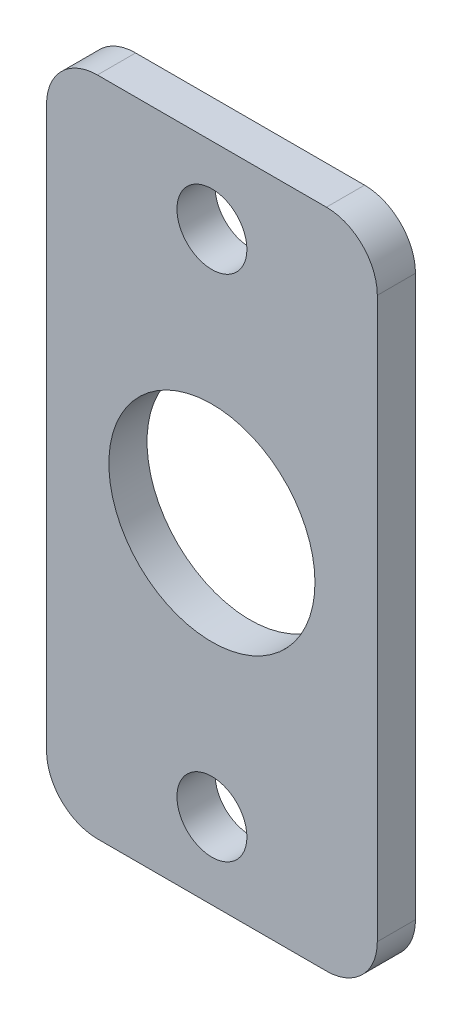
ISO-10303-21;
HEADER;
FILE_DESCRIPTION(('STEP AP214'),'2;1');
FILE_NAME('part.step','',(''),(''),'','','');
FILE_SCHEMA(('AUTOMOTIVE_DESIGN { 1 0 10303 214 1 1 1 1 }'));
ENDSEC;
DATA;
#1=APPLICATION_CONTEXT('core data for automotive mechanical design processes');
#2=APPLICATION_PROTOCOL_DEFINITION('international standard','automotive_design',2000,#1);
#3=PRODUCT_CONTEXT('',#1,'mechanical');
#4=PRODUCT('Part','Part','',(#3));
#5=PRODUCT_RELATED_PRODUCT_CATEGORY('part','',(#4));
#6=PRODUCT_DEFINITION_FORMATION('','',#4);
#7=PRODUCT_DEFINITION_CONTEXT('part definition',#1,'design');
#8=PRODUCT_DEFINITION('design','',#6,#7);
#9=PRODUCT_DEFINITION_SHAPE('','',#8);
#10=(LENGTH_UNIT() NAMED_UNIT(*) SI_UNIT(.MILLI.,.METRE.));
#11=(NAMED_UNIT(*) PLANE_ANGLE_UNIT() SI_UNIT($,.RADIAN.));
#12=(NAMED_UNIT(*) SI_UNIT($,.STERADIAN.) SOLID_ANGLE_UNIT());
#13=UNCERTAINTY_MEASURE_WITH_UNIT(LENGTH_MEASURE(1.E-05),#10,'distance_accuracy_value','');
#14=(GEOMETRIC_REPRESENTATION_CONTEXT(3) GLOBAL_UNCERTAINTY_ASSIGNED_CONTEXT((#13)) GLOBAL_UNIT_ASSIGNED_CONTEXT((#10,
#11,#12)) REPRESENTATION_CONTEXT('',''));
#15=CARTESIAN_POINT('',(0.,0.,0.));
#16=DIRECTION('',(0.,0.,1.));
#17=DIRECTION('',(1.,0.,0.));
#18=AXIS2_PLACEMENT_3D('',#15,#16,#17);
#19=CARTESIAN_POINT('',(-9.,22.,-3.));
#20=DIRECTION('',(0.,0.,1.));
#21=DIRECTION('',(1.,0.,0.));
#22=AXIS2_PLACEMENT_3D('',#19,#20,#21);
#23=CYLINDRICAL_SURFACE('',#22,4.);
#24=CARTESIAN_POINT('',(-9.,22.,0.));
#25=DIRECTION('',(0.,0.,1.));
#26=DIRECTION('',(1.,0.,0.));
#27=AXIS2_PLACEMENT_3D('',#24,#25,#26);
#28=CIRCLE('',#27,4.);
#29=CARTESIAN_POINT('',(-9.,26.,0.));
#30=VERTEX_POINT('',#29);
#31=CARTESIAN_POINT('',(-13.,22.,0.));
#32=VERTEX_POINT('',#31);
#33=EDGE_CURVE('E113',#30,#32,#28,.T.);
#34=ORIENTED_EDGE('',*,*,#33,.F.);
#35=DIRECTION('',(0.,0.,1.));
#36=VECTOR('',#35,1.);
#37=CARTESIAN_POINT('',(-9.,26.,-3.));
#38=LINE('',#37,#36);
#39=CARTESIAN_POINT('',(-9.,26.,-3.));
#40=VERTEX_POINT('',#39);
#41=EDGE_CURVE('E11',#40,#30,#38,.T.);
#42=ORIENTED_EDGE('',*,*,#41,.F.);
#43=CARTESIAN_POINT('',(-9.,22.,-3.));
#44=DIRECTION('',(0.,0.,1.));
#45=DIRECTION('',(1.,0.,0.));
#46=AXIS2_PLACEMENT_3D('',#43,#44,#45);
#47=CIRCLE('',#46,4.);
#48=CARTESIAN_POINT('',(-13.,22.,-3.));
#49=VERTEX_POINT('',#48);
#50=EDGE_CURVE('E134',#40,#49,#47,.T.);
#51=ORIENTED_EDGE('',*,*,#50,.T.);
#52=DIRECTION('',(0.,0.,1.));
#53=VECTOR('',#52,1.);
#54=CARTESIAN_POINT('',(-13.,22.,-3.));
#55=LINE('',#54,#53);
#56=EDGE_CURVE('E19',#49,#32,#55,.T.);
#57=ORIENTED_EDGE('',*,*,#56,.T.);
#58=EDGE_LOOP('',(#34,#42,#51,#57));
#59=FACE_BOUND('',#58,.T.);
#60=ADVANCED_FACE('F16',(#59),#23,.T.);
#61=CARTESIAN_POINT('',(9.,26.,-3.));
#62=DIRECTION('',(0.,1.,0.));
#63=DIRECTION('',(0.,0.,1.));
#64=AXIS2_PLACEMENT_3D('',#61,#62,#63);
#65=PLANE('',#64);
#66=DIRECTION('',(-1.,0.,0.));
#67=VECTOR('',#66,1.);
#68=CARTESIAN_POINT('',(9.,26.,0.));
#69=LINE('',#68,#67);
#70=CARTESIAN_POINT('',(9.,26.,0.));
#71=VERTEX_POINT('',#70);
#72=EDGE_CURVE('E132',#71,#30,#69,.T.);
#73=ORIENTED_EDGE('',*,*,#72,.F.);
#74=DIRECTION('',(0.,0.,1.));
#75=VECTOR('',#74,1.);
#76=CARTESIAN_POINT('',(9.,26.,-3.));
#77=LINE('',#76,#75);
#78=CARTESIAN_POINT('',(9.,26.,-3.));
#79=VERTEX_POINT('',#78);
#80=EDGE_CURVE('E25',#79,#71,#77,.T.);
#81=ORIENTED_EDGE('',*,*,#80,.F.);
#82=DIRECTION('',(-1.,0.,0.));
#83=VECTOR('',#82,1.);
#84=CARTESIAN_POINT('',(9.,26.,-3.));
#85=LINE('',#84,#83);
#86=EDGE_CURVE('E103',#79,#40,#85,.T.);
#87=ORIENTED_EDGE('',*,*,#86,.T.);
#88=ORIENTED_EDGE('',*,*,#41,.T.);
#89=EDGE_LOOP('',(#73,#81,#87,#88));
#90=FACE_BOUND('',#89,.T.);
#91=ADVANCED_FACE('F146',(#90),#65,.T.);
#92=CARTESIAN_POINT('',(9.,22.,-3.));
#93=DIRECTION('',(0.,0.,1.));
#94=DIRECTION('',(1.,0.,0.));
#95=AXIS2_PLACEMENT_3D('',#92,#93,#94);
#96=CYLINDRICAL_SURFACE('',#95,4.);
#97=CARTESIAN_POINT('',(9.,22.,0.));
#98=DIRECTION('',(0.,0.,1.));
#99=DIRECTION('',(1.,0.,0.));
#100=AXIS2_PLACEMENT_3D('',#97,#98,#99);
#101=CIRCLE('',#100,4.);
#102=CARTESIAN_POINT('',(13.,22.,0.));
#103=VERTEX_POINT('',#102);
#104=EDGE_CURVE('E90',#103,#71,#101,.T.);
#105=ORIENTED_EDGE('',*,*,#104,.F.);
#106=DIRECTION('',(0.,0.,1.));
#107=VECTOR('',#106,1.);
#108=CARTESIAN_POINT('',(13.,22.,-3.));
#109=LINE('',#108,#107);
#110=CARTESIAN_POINT('',(13.,22.,-3.));
#111=VERTEX_POINT('',#110);
#112=EDGE_CURVE('E85',#111,#103,#109,.T.);
#113=ORIENTED_EDGE('',*,*,#112,.F.);
#114=CARTESIAN_POINT('',(9.,22.,-3.));
#115=DIRECTION('',(0.,0.,1.));
#116=DIRECTION('',(1.,0.,0.));
#117=AXIS2_PLACEMENT_3D('',#114,#115,#116);
#118=CIRCLE('',#117,4.);
#119=EDGE_CURVE('E88',#111,#79,#118,.T.);
#120=ORIENTED_EDGE('',*,*,#119,.T.);
#121=ORIENTED_EDGE('',*,*,#80,.T.);
#122=EDGE_LOOP('',(#105,#113,#120,#121));
#123=FACE_BOUND('',#122,.T.);
#124=ADVANCED_FACE('F87',(#123),#96,.T.);
#125=CARTESIAN_POINT('',(13.,-22.,-3.));
#126=DIRECTION('',(1.,0.,0.));
#127=DIRECTION('',(0.,1.,0.));
#128=AXIS2_PLACEMENT_3D('',#125,#126,#127);
#129=PLANE('',#128);
#130=DIRECTION('',(0.,1.,0.));
#131=VECTOR('',#130,1.);
#132=CARTESIAN_POINT('',(13.,-22.,0.));
#133=LINE('',#132,#131);
#134=CARTESIAN_POINT('',(13.,-22.,0.));
#135=VERTEX_POINT('',#134);
#136=EDGE_CURVE('E129',#135,#103,#133,.T.);
#137=ORIENTED_EDGE('',*,*,#136,.F.);
#138=DIRECTION('',(0.,0.,1.));
#139=VECTOR('',#138,1.);
#140=CARTESIAN_POINT('',(13.,-22.,-3.));
#141=LINE('',#140,#139);
#142=CARTESIAN_POINT('',(13.,-22.,-3.));
#143=VERTEX_POINT('',#142);
#144=EDGE_CURVE('E95',#143,#135,#141,.T.);
#145=ORIENTED_EDGE('',*,*,#144,.F.);
#146=DIRECTION('',(0.,1.,0.));
#147=VECTOR('',#146,1.);
#148=CARTESIAN_POINT('',(13.,-22.,-3.));
#149=LINE('',#148,#147);
#150=EDGE_CURVE('E101',#143,#111,#149,.T.);
#151=ORIENTED_EDGE('',*,*,#150,.T.);
#152=ORIENTED_EDGE('',*,*,#112,.T.);
#153=EDGE_LOOP('',(#137,#145,#151,#152));
#154=FACE_BOUND('',#153,.T.);
#155=ADVANCED_FACE('F105',(#154),#129,.T.);
#156=CARTESIAN_POINT('',(9.,-22.,-3.));
#157=DIRECTION('',(0.,0.,1.));
#158=DIRECTION('',(1.,0.,0.));
#159=AXIS2_PLACEMENT_3D('',#156,#157,#158);
#160=CYLINDRICAL_SURFACE('',#159,4.);
#161=CARTESIAN_POINT('',(9.,-22.,0.));
#162=DIRECTION('',(0.,0.,1.));
#163=DIRECTION('',(1.,0.,0.));
#164=AXIS2_PLACEMENT_3D('',#161,#162,#163);
#165=CIRCLE('',#164,4.);
#166=CARTESIAN_POINT('',(9.,-26.,0.));
#167=VERTEX_POINT('',#166);
#168=EDGE_CURVE('E126',#167,#135,#165,.T.);
#169=ORIENTED_EDGE('',*,*,#168,.F.);
#170=DIRECTION('',(0.,0.,1.));
#171=VECTOR('',#170,1.);
#172=CARTESIAN_POINT('',(9.,-26.,-3.));
#173=LINE('',#172,#171);
#174=CARTESIAN_POINT('',(9.,-26.,-3.));
#175=VERTEX_POINT('',#174);
#176=EDGE_CURVE('E138',#175,#167,#173,.T.);
#177=ORIENTED_EDGE('',*,*,#176,.F.);
#178=CARTESIAN_POINT('',(9.,-22.,-3.));
#179=DIRECTION('',(0.,0.,1.));
#180=DIRECTION('',(1.,0.,0.));
#181=AXIS2_PLACEMENT_3D('',#178,#179,#180);
#182=CIRCLE('',#181,4.);
#183=EDGE_CURVE('E106',#175,#143,#182,.T.);
#184=ORIENTED_EDGE('',*,*,#183,.T.);
#185=ORIENTED_EDGE('',*,*,#144,.T.);
#186=EDGE_LOOP('',(#169,#177,#184,#185));
#187=FACE_BOUND('',#186,.T.);
#188=ADVANCED_FACE('F161',(#187),#160,.T.);
#189=CARTESIAN_POINT('',(-9.,-26.,-3.));
#190=DIRECTION('',(0.,-1.,0.));
#191=DIRECTION('',(0.,0.,-1.));
#192=AXIS2_PLACEMENT_3D('',#189,#190,#191);
#193=PLANE('',#192);
#194=DIRECTION('',(1.,0.,0.));
#195=VECTOR('',#194,1.);
#196=CARTESIAN_POINT('',(-9.,-26.,0.));
#197=LINE('',#196,#195);
#198=CARTESIAN_POINT('',(-9.,-26.,0.));
#199=VERTEX_POINT('',#198);
#200=EDGE_CURVE('E123',#199,#167,#197,.T.);
#201=ORIENTED_EDGE('',*,*,#200,.F.);
#202=DIRECTION('',(0.,0.,1.));
#203=VECTOR('',#202,1.);
#204=CARTESIAN_POINT('',(-9.,-26.,-3.));
#205=LINE('',#204,#203);
#206=CARTESIAN_POINT('',(-9.,-26.,-3.));
#207=VERTEX_POINT('',#206);
#208=EDGE_CURVE('E140',#207,#199,#205,.T.);
#209=ORIENTED_EDGE('',*,*,#208,.F.);
#210=DIRECTION('',(1.,0.,0.));
#211=VECTOR('',#210,1.);
#212=CARTESIAN_POINT('',(-9.,-26.,-3.));
#213=LINE('',#212,#211);
#214=EDGE_CURVE('E108',#207,#175,#213,.T.);
#215=ORIENTED_EDGE('',*,*,#214,.T.);
#216=ORIENTED_EDGE('',*,*,#176,.T.);
#217=EDGE_LOOP('',(#201,#209,#215,#216));
#218=FACE_BOUND('',#217,.T.);
#219=ADVANCED_FACE('F164',(#218),#193,.T.);
#220=CARTESIAN_POINT('',(-9.,-22.,-3.));
#221=DIRECTION('',(0.,0.,1.));
#222=DIRECTION('',(1.,0.,0.));
#223=AXIS2_PLACEMENT_3D('',#220,#221,#222);
#224=CYLINDRICAL_SURFACE('',#223,4.);
#225=CARTESIAN_POINT('',(-9.,-22.,0.));
#226=DIRECTION('',(0.,0.,1.));
#227=DIRECTION('',(1.,0.,0.));
#228=AXIS2_PLACEMENT_3D('',#225,#226,#227);
#229=CIRCLE('',#228,4.);
#230=CARTESIAN_POINT('',(-13.,-22.,0.));
#231=VERTEX_POINT('',#230);
#232=EDGE_CURVE('E120',#231,#199,#229,.T.);
#233=ORIENTED_EDGE('',*,*,#232,.F.);
#234=DIRECTION('',(0.,0.,1.));
#235=VECTOR('',#234,1.);
#236=CARTESIAN_POINT('',(-13.,-22.,-3.));
#237=LINE('',#236,#235);
#238=CARTESIAN_POINT('',(-13.,-22.,-3.));
#239=VERTEX_POINT('',#238);
#240=EDGE_CURVE('E141',#239,#231,#237,.T.);
#241=ORIENTED_EDGE('',*,*,#240,.F.);
#242=CARTESIAN_POINT('',(-9.,-22.,-3.));
#243=DIRECTION('',(0.,0.,1.));
#244=DIRECTION('',(1.,0.,0.));
#245=AXIS2_PLACEMENT_3D('',#242,#243,#244);
#246=CIRCLE('',#245,4.);
#247=EDGE_CURVE('E223',#239,#207,#246,.T.);
#248=ORIENTED_EDGE('',*,*,#247,.T.);
#249=ORIENTED_EDGE('',*,*,#208,.T.);
#250=EDGE_LOOP('',(#233,#241,#248,#249));
#251=FACE_BOUND('',#250,.T.);
#252=ADVANCED_FACE('F168',(#251),#224,.T.);
#253=CARTESIAN_POINT('',(-13.,22.,-3.));
#254=DIRECTION('',(-1.,0.,0.));
#255=DIRECTION('',(0.,-1.,0.));
#256=AXIS2_PLACEMENT_3D('',#253,#254,#255);
#257=PLANE('',#256);
#258=DIRECTION('',(0.,-1.,0.));
#259=VECTOR('',#258,1.);
#260=CARTESIAN_POINT('',(-13.,22.,0.));
#261=LINE('',#260,#259);
#262=EDGE_CURVE('E116',#32,#231,#261,.T.);
#263=ORIENTED_EDGE('',*,*,#262,.F.);
#264=ORIENTED_EDGE('',*,*,#56,.F.);
#265=DIRECTION('',(0.,-1.,0.));
#266=VECTOR('',#265,1.);
#267=CARTESIAN_POINT('',(-13.,22.,-3.));
#268=LINE('',#267,#266);
#269=EDGE_CURVE('E221',#49,#239,#268,.T.);
#270=ORIENTED_EDGE('',*,*,#269,.T.);
#271=ORIENTED_EDGE('',*,*,#240,.T.);
#272=EDGE_LOOP('',(#263,#264,#270,#271));
#273=FACE_BOUND('',#272,.T.);
#274=ADVANCED_FACE('F143',(#273),#257,.T.);
#275=CARTESIAN_POINT('',(-9.,22.,-3.));
#276=DIRECTION('',(0.,0.,1.));
#277=DIRECTION('',(1.,0.,0.));
#278=AXIS2_PLACEMENT_3D('',#275,#276,#277);
#279=PLANE('',#278);
#280=CARTESIAN_POINT('',(0.,0.,-3.));
#281=DIRECTION('',(0.,0.,1.));
#282=DIRECTION('',(1.,0.,0.));
#283=AXIS2_PLACEMENT_3D('',#280,#281,#282);
#284=CIRCLE('',#283,8.1);
#285=CARTESIAN_POINT('',(8.1,0.,-3.));
#286=VERTEX_POINT('',#285);
#287=EDGE_CURVE('E202',#286,#286,#284,.T.);
#288=ORIENTED_EDGE('',*,*,#287,.T.);
#289=EDGE_LOOP('',(#288));
#290=FACE_BOUND('',#289,.T.);
#291=CARTESIAN_POINT('',(0.,20.,-3.));
#292=DIRECTION('',(0.,0.,1.));
#293=DIRECTION('',(1.,0.,0.));
#294=AXIS2_PLACEMENT_3D('',#291,#292,#293);
#295=CIRCLE('',#294,2.75);
#296=CARTESIAN_POINT('',(2.75,20.,-3.));
#297=VERTEX_POINT('',#296);
#298=EDGE_CURVE('E210',#297,#297,#295,.T.);
#299=ORIENTED_EDGE('',*,*,#298,.T.);
#300=EDGE_LOOP('',(#299));
#301=FACE_BOUND('',#300,.T.);
#302=CARTESIAN_POINT('',(0.,-20.,-3.));
#303=DIRECTION('',(0.,0.,1.));
#304=DIRECTION('',(1.,0.,0.));
#305=AXIS2_PLACEMENT_3D('',#302,#303,#304);
#306=CIRCLE('',#305,2.75);
#307=CARTESIAN_POINT('',(2.75,-20.,-3.));
#308=VERTEX_POINT('',#307);
#309=EDGE_CURVE('E117',#308,#308,#306,.T.);
#310=ORIENTED_EDGE('',*,*,#309,.T.);
#311=EDGE_LOOP('',(#310));
#312=FACE_BOUND('',#311,.T.);
#313=ORIENTED_EDGE('',*,*,#50,.F.);
#314=ORIENTED_EDGE('',*,*,#86,.F.);
#315=ORIENTED_EDGE('',*,*,#119,.F.);
#316=ORIENTED_EDGE('',*,*,#150,.F.);
#317=ORIENTED_EDGE('',*,*,#183,.F.);
#318=ORIENTED_EDGE('',*,*,#214,.F.);
#319=ORIENTED_EDGE('',*,*,#247,.F.);
#320=ORIENTED_EDGE('',*,*,#269,.F.);
#321=EDGE_LOOP('',(#313,#314,#315,#316,#317,#318,#319,#320));
#322=FACE_BOUND('',#321,.T.);
#323=ADVANCED_FACE('F99',(#290,#301,#312,#322),#279,.F.);
#324=CARTESIAN_POINT('',(-9.,22.,0.));
#325=DIRECTION('',(0.,0.,1.));
#326=DIRECTION('',(1.,0.,0.));
#327=AXIS2_PLACEMENT_3D('',#324,#325,#326);
#328=PLANE('',#327);
#329=CARTESIAN_POINT('',(0.,0.,0.));
#330=DIRECTION('',(0.,0.,1.));
#331=DIRECTION('',(1.,0.,0.));
#332=AXIS2_PLACEMENT_3D('',#329,#330,#331);
#333=CIRCLE('',#332,8.1);
#334=CARTESIAN_POINT('',(8.1,0.,0.));
#335=VERTEX_POINT('',#334);
#336=EDGE_CURVE('E205',#335,#335,#333,.T.);
#337=ORIENTED_EDGE('',*,*,#336,.F.);
#338=EDGE_LOOP('',(#337));
#339=FACE_BOUND('',#338,.T.);
#340=CARTESIAN_POINT('',(0.,20.,0.));
#341=DIRECTION('',(0.,0.,1.));
#342=DIRECTION('',(1.,0.,0.));
#343=AXIS2_PLACEMENT_3D('',#340,#341,#342);
#344=CIRCLE('',#343,2.75);
#345=CARTESIAN_POINT('',(2.75,20.,0.));
#346=VERTEX_POINT('',#345);
#347=EDGE_CURVE('E207',#346,#346,#344,.T.);
#348=ORIENTED_EDGE('',*,*,#347,.F.);
#349=EDGE_LOOP('',(#348));
#350=FACE_BOUND('',#349,.T.);
#351=CARTESIAN_POINT('',(0.,-20.,0.));
#352=DIRECTION('',(0.,0.,1.));
#353=DIRECTION('',(1.,0.,0.));
#354=AXIS2_PLACEMENT_3D('',#351,#352,#353);
#355=CIRCLE('',#354,2.75);
#356=CARTESIAN_POINT('',(2.75,-20.,0.));
#357=VERTEX_POINT('',#356);
#358=EDGE_CURVE('E213',#357,#357,#355,.T.);
#359=ORIENTED_EDGE('',*,*,#358,.F.);
#360=EDGE_LOOP('',(#359));
#361=FACE_BOUND('',#360,.T.);
#362=ORIENTED_EDGE('',*,*,#33,.T.);
#363=ORIENTED_EDGE('',*,*,#262,.T.);
#364=ORIENTED_EDGE('',*,*,#232,.T.);
#365=ORIENTED_EDGE('',*,*,#200,.T.);
#366=ORIENTED_EDGE('',*,*,#168,.T.);
#367=ORIENTED_EDGE('',*,*,#136,.T.);
#368=ORIENTED_EDGE('',*,*,#104,.T.);
#369=ORIENTED_EDGE('',*,*,#72,.T.);
#370=EDGE_LOOP('',(#362,#363,#364,#365,#366,#367,#368,#369));
#371=FACE_BOUND('',#370,.T.);
#372=ADVANCED_FACE('F145',(#339,#350,#361,#371),#328,.T.);
#373=CARTESIAN_POINT('',(0.,-20.,-3.));
#374=DIRECTION('',(0.,0.,1.));
#375=DIRECTION('',(1.,0.,0.));
#376=AXIS2_PLACEMENT_3D('',#373,#374,#375);
#377=CYLINDRICAL_SURFACE('',#376,2.75);
#378=ORIENTED_EDGE('',*,*,#309,.F.);
#379=EDGE_LOOP('',(#378));
#380=FACE_BOUND('',#379,.T.);
#381=ORIENTED_EDGE('',*,*,#358,.T.);
#382=EDGE_LOOP('',(#381));
#383=FACE_BOUND('',#382,.T.);
#384=ADVANCED_FACE('F182',(#380,#383),#377,.F.);
#385=CARTESIAN_POINT('',(0.,20.,-3.));
#386=DIRECTION('',(0.,0.,1.));
#387=DIRECTION('',(1.,0.,0.));
#388=AXIS2_PLACEMENT_3D('',#385,#386,#387);
#389=CYLINDRICAL_SURFACE('',#388,2.75);
#390=ORIENTED_EDGE('',*,*,#298,.F.);
#391=EDGE_LOOP('',(#390));
#392=FACE_BOUND('',#391,.T.);
#393=ORIENTED_EDGE('',*,*,#347,.T.);
#394=EDGE_LOOP('',(#393));
#395=FACE_BOUND('',#394,.T.);
#396=ADVANCED_FACE('F189',(#392,#395),#389,.F.);
#397=CARTESIAN_POINT('',(0.,0.,-3.));
#398=DIRECTION('',(0.,0.,1.));
#399=DIRECTION('',(1.,0.,0.));
#400=AXIS2_PLACEMENT_3D('',#397,#398,#399);
#401=CYLINDRICAL_SURFACE('',#400,8.1);
#402=ORIENTED_EDGE('',*,*,#287,.F.);
#403=EDGE_LOOP('',(#402));
#404=FACE_BOUND('',#403,.T.);
#405=ORIENTED_EDGE('',*,*,#336,.T.);
#406=EDGE_LOOP('',(#405));
#407=FACE_BOUND('',#406,.T.);
#408=ADVANCED_FACE('F193',(#404,#407),#401,.F.);
#409=CLOSED_SHELL('',(#60,#91,#124,#155,#188,#219,#252,#274,#323,#372,#384,#396,#408));
#410=MANIFOLD_SOLID_BREP('B1',#409);
#411=ADVANCED_BREP_SHAPE_REPRESENTATION('',(#18,#410),#14);
#412=SHAPE_DEFINITION_REPRESENTATION(#9,#411);
ENDSEC;
END-ISO-10303-21;
